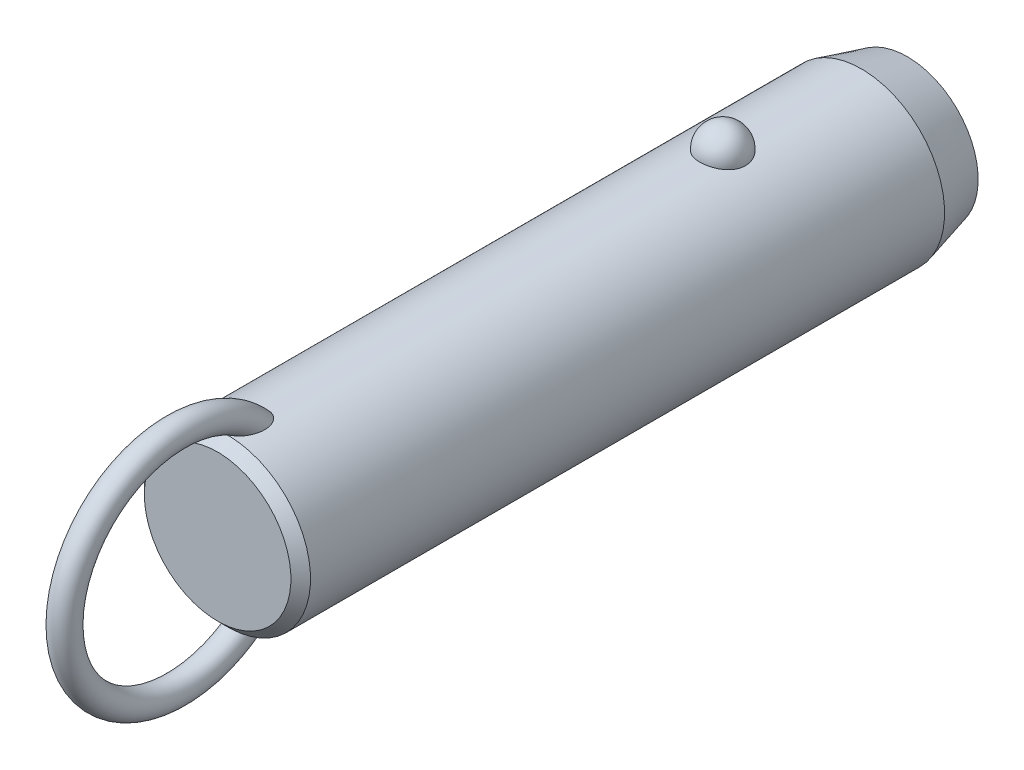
ISO-10303-21;
HEADER;
FILE_DESCRIPTION(('STEP AP214'),'2;1');
FILE_NAME('part.step','',(''),(''),'','','');
FILE_SCHEMA(('AUTOMOTIVE_DESIGN { 1 0 10303 214 1 1 1 1 }'));
ENDSEC;
DATA;
#1=APPLICATION_CONTEXT('core data for automotive mechanical design processes');
#2=APPLICATION_PROTOCOL_DEFINITION('international standard','automotive_design',2000,#1);
#3=PRODUCT_CONTEXT('',#1,'mechanical');
#4=PRODUCT('Part','Part','',(#3));
#5=PRODUCT_RELATED_PRODUCT_CATEGORY('part','',(#4));
#6=PRODUCT_DEFINITION_FORMATION('','',#4);
#7=PRODUCT_DEFINITION_CONTEXT('part definition',#1,'design');
#8=PRODUCT_DEFINITION('design','',#6,#7);
#9=PRODUCT_DEFINITION_SHAPE('','',#8);
#10=(LENGTH_UNIT() NAMED_UNIT(*) SI_UNIT(.MILLI.,.METRE.));
#11=(NAMED_UNIT(*) PLANE_ANGLE_UNIT() SI_UNIT($,.RADIAN.));
#12=(NAMED_UNIT(*) SI_UNIT($,.STERADIAN.) SOLID_ANGLE_UNIT());
#13=UNCERTAINTY_MEASURE_WITH_UNIT(LENGTH_MEASURE(1.E-05),#10,'distance_accuracy_value','');
#14=(GEOMETRIC_REPRESENTATION_CONTEXT(3) GLOBAL_UNCERTAINTY_ASSIGNED_CONTEXT((#13)) GLOBAL_UNIT_ASSIGNED_CONTEXT((#10,
#11,#12)) REPRESENTATION_CONTEXT('',''));
#15=CARTESIAN_POINT('',(0.,0.,0.));
#16=DIRECTION('',(0.,0.,1.));
#17=DIRECTION('',(1.,0.,0.));
#18=AXIS2_PLACEMENT_3D('',#15,#16,#17);
#19=CARTESIAN_POINT('',(0.,0.,61.));
#20=DIRECTION('',(0.,0.,-1.));
#21=DIRECTION('',(-1.,0.,0.));
#22=AXIS2_PLACEMENT_3D('',#19,#20,#21);
#23=CYLINDRICAL_SURFACE('',#22,12.7);
#24=CARTESIAN_POINT('',(3.46661256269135,12.2177165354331,-3.5));
#25=CARTESIAN_POINT('',(3.4666090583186,12.2177194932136,-3.30432790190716));
#26=CARTESIAN_POINT('',(3.45063567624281,12.2222841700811,-3.10861112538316));
#27=CARTESIAN_POINT('',(3.38712451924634,12.2400345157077,-2.72271899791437));
#28=CARTESIAN_POINT('',(3.33957415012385,12.2532236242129,-2.53254588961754));
#29=CARTESIAN_POINT('',(3.2141234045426,12.286724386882,-2.16324948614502));
#30=CARTESIAN_POINT('',(3.13623639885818,12.3070329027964,-1.98412136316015));
#31=CARTESIAN_POINT('',(2.95205930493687,12.3525018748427,-1.64180592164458));
#32=CARTESIAN_POINT('',(2.84577003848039,12.3776621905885,-1.47861814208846));
#33=CARTESIAN_POINT('',(2.60688050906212,12.4301712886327,-1.17190583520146));
#34=CARTESIAN_POINT('',(2.47415697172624,12.4575299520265,-1.02847897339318));
#35=CARTESIAN_POINT('',(2.18615174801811,12.5112810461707,-0.766177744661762));
#36=CARTESIAN_POINT('',(2.03087002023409,12.5376734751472,-0.64730342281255));
#37=CARTESIAN_POINT('',(1.70237334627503,12.5864761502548,-0.437732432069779));
#38=CARTESIAN_POINT('',(1.52920948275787,12.6088972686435,-0.346958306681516));
#39=CARTESIAN_POINT('',(1.16944170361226,12.6473352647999,-0.195750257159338));
#40=CARTESIAN_POINT('',(0.982839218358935,12.663352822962,-0.135313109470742));
#41=CARTESIAN_POINT('',(0.604961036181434,12.6869706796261,-0.0473241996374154));
#42=CARTESIAN_POINT('',(0.413823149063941,12.6947125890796,-0.0192185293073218));
#43=CARTESIAN_POINT('',(0.0293827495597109,12.7014203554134,0.00517254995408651));
#44=CARTESIAN_POINT('',(-0.163919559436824,12.7003870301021,0.00146092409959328));
#45=CARTESIAN_POINT('',(-0.544374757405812,12.689735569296,-0.0373939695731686));
#46=CARTESIAN_POINT('',(-0.731575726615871,12.6802364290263,-0.0721015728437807));
#47=CARTESIAN_POINT('',(-1.09733277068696,12.6538333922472,-0.171364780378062));
#48=CARTESIAN_POINT('',(-1.27588869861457,12.6369293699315,-0.235920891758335));
#49=CARTESIAN_POINT('',(-1.6204698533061,12.5973946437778,-0.393548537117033));
#50=CARTESIAN_POINT('',(-1.78641865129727,12.5747321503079,-0.486778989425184));
#51=CARTESIAN_POINT('',(-2.10030671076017,12.5261316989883,-0.699110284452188));
#52=CARTESIAN_POINT('',(-2.24824419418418,12.5001934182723,-0.818213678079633));
#53=CARTESIAN_POINT('',(-2.52491489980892,12.4472906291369,-1.08157124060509));
#54=CARTESIAN_POINT('',(-2.65324222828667,12.4203160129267,-1.22624992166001));
#55=CARTESIAN_POINT('',(-2.88410007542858,12.3687509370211,-1.53528325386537));
#56=CARTESIAN_POINT('',(-2.98662883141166,12.3441606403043,-1.69963924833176));
#57=CARTESIAN_POINT('',(-3.16432417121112,12.2998199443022,-2.04548497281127));
#58=CARTESIAN_POINT('',(-3.23917525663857,12.2801261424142,-2.22714424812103));
#59=CARTESIAN_POINT('',(-3.35800573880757,12.248167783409,-2.6009138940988));
#60=CARTESIAN_POINT('',(-3.4019860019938,12.2359030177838,-2.79302397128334));
#61=CARTESIAN_POINT('',(-3.45784812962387,12.2202347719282,-3.18140279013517));
#62=CARTESIAN_POINT('',(-3.46986123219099,12.2167950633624,-3.37765118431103));
#63=CARTESIAN_POINT('',(-3.46186273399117,12.2190638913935,-3.76943689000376));
#64=CARTESIAN_POINT('',(-3.44185196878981,12.2247721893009,-3.96497421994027));
#65=CARTESIAN_POINT('',(-3.37048652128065,12.2446381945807,-4.34881728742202));
#66=CARTESIAN_POINT('',(-3.31928253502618,12.2587552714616,-4.53715319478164));
#67=CARTESIAN_POINT('',(-3.18693461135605,12.2938237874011,-4.90231727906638));
#68=CARTESIAN_POINT('',(-3.1057895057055,12.3147754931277,-5.07914500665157));
#69=CARTESIAN_POINT('',(-2.91506431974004,12.3613125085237,-5.41732059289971));
#70=CARTESIAN_POINT('',(-2.80533587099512,12.3869217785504,-5.57858147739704));
#71=CARTESIAN_POINT('',(-2.560414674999,12.4398525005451,-5.88013283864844));
#72=CARTESIAN_POINT('',(-2.42522099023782,12.4671740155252,-6.02042254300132));
#73=CARTESIAN_POINT('',(-2.1323357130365,12.5205965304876,-6.27662798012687));
#74=CARTESIAN_POINT('',(-1.97456596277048,12.5466928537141,-6.3924554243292));
#75=CARTESIAN_POINT('',(-1.64115839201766,12.5946384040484,-6.59583547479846));
#76=CARTESIAN_POINT('',(-1.46552179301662,12.6164879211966,-6.68339001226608));
#77=CARTESIAN_POINT('',(-1.10356050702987,12.6532533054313,-6.82682153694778));
#78=CARTESIAN_POINT('',(-0.917391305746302,12.6682500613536,-6.8830698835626));
#79=CARTESIAN_POINT('',(-0.537836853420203,12.6900288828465,-6.96386887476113));
#80=CARTESIAN_POINT('',(-0.344452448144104,12.6968119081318,-6.9884232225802));
#81=CARTESIAN_POINT('',(0.0402577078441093,12.7013667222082,-7.00496469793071));
#82=CARTESIAN_POINT('',(0.231556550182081,12.6993008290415,-6.99753844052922));
#83=CARTESIAN_POINT('',(0.610105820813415,12.6867505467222,-6.9516636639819));
#84=CARTESIAN_POINT('',(0.797356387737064,12.6762664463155,-6.913216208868));
#85=CARTESIAN_POINT('',(1.16186657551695,12.6480587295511,-6.80658431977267));
#86=CARTESIAN_POINT('',(1.33915951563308,12.6303611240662,-6.73850666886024));
#87=CARTESIAN_POINT('',(1.67968518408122,12.5896027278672,-6.57450875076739));
#88=CARTESIAN_POINT('',(1.84291705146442,12.5665416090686,-6.47858678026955));
#89=CARTESIAN_POINT('',(2.15340192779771,12.5171072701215,-6.25982455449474));
#90=CARTESIAN_POINT('',(2.30037831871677,12.4906895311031,-6.13660186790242));
#91=CARTESIAN_POINT('',(2.5717412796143,12.4376567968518,-5.86739587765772));
#92=CARTESIAN_POINT('',(2.69612388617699,12.4110417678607,-5.72140858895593));
#93=CARTESIAN_POINT('',(2.92107785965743,12.360051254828,-5.40794137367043));
#94=CARTESIAN_POINT('',(3.02121329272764,12.3357209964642,-5.24014110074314));
#95=CARTESIAN_POINT('',(3.19236291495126,12.2925446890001,-4.8896986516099));
#96=CARTESIAN_POINT('',(3.26338839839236,12.2736965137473,-4.70706226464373));
#97=CARTESIAN_POINT('',(3.36788038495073,12.245404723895,-4.35469510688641));
#98=CARTESIAN_POINT('',(3.40484026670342,12.2351018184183,-4.18605935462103));
#99=CARTESIAN_POINT('',(3.45420764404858,12.2212564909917,-3.84496058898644));
#100=CARTESIAN_POINT('',(3.46661565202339,12.2177139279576,-3.67249765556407));
#101=CARTESIAN_POINT('',(3.46661256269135,12.2177165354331,-3.5));
#102=B_SPLINE_CURVE_WITH_KNOTS('',3,(#24,#25,#26,#27,#28,#29,#30,#31,#32,#33,#34,#35,#36,#37,
#38,#39,#40,#41,#42,#43,#44,#45,#46,#47,#48,#49,#50,#51,#52,#53,#54,#55,#56,#57,#58,#59,#60,#61,
#62,#63,#64,#65,#66,#67,#68,#69,#70,#71,#72,#73,#74,#75,#76,#77,#78,#79,#80,#81,#82,#83,#84,#85,
#86,#87,#88,#89,#90,#91,#92,#93,#94,#95,#96,#97,#98,#99,#100,#101),.UNSPECIFIED.,.T.,.F.,(4,2,2,
2,2,2,2,2,2,2,2,2,2,2,2,2,2,2,2,2,2,2,2,2,2,2,2,2,2,2,2,2,2,2,2,2,2,2,4),(0.,0.586396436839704,
1.17302689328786,1.7593990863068,2.34575431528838,2.93491084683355,3.52406845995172,
4.11158733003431,4.69904375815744,5.2762784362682,5.85345931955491,6.42265312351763,
6.99185659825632,7.56427334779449,8.136746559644,8.71981013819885,9.3029135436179,
9.89247258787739,10.4820150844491,11.0691335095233,11.6562366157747,12.2405256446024,
12.8248374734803,13.412244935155,13.9996740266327,14.5891883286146,15.1786623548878,
15.7609861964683,16.3432419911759,16.9148635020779,17.4864654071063,18.0560241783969,
18.6256177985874,19.2037609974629,19.7820055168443,20.3699810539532,20.9577282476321,
21.4746855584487,21.9916320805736),.UNSPECIFIED.);
#103=CARTESIAN_POINT('',(3.46661256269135,12.2177165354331,-3.5));
#104=VERTEX_POINT('',#103);
#105=EDGE_CURVE('E41',#104,#104,#102,.T.);
#106=ORIENTED_EDGE('',*,*,#105,.T.);
#107=EDGE_LOOP('',(#106));
#108=FACE_BOUND('',#107,.T.);
#109=CARTESIAN_POINT('',(0.,0.,72.2000000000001));
#110=DIRECTION('',(0.,0.,1.));
#111=DIRECTION('',(1.,0.,0.));
#112=AXIS2_PLACEMENT_3D('',#109,#110,#111);
#113=CIRCLE('',#112,12.7);
#114=CARTESIAN_POINT('',(-12.7,0.,72.2000000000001));
#115=VERTEX_POINT('',#114);
#116=EDGE_CURVE('E10',#115,#115,#113,.F.);
#117=ORIENTED_EDGE('',*,*,#116,.T.);
#118=EDGE_LOOP('',(#117));
#119=FACE_BOUND('',#118,.T.);
#120=CARTESIAN_POINT('',(-0.548122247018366,-12.6881662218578,65.9432187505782));
#121=CARTESIAN_POINT('',(-0.648865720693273,-12.6838128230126,65.977926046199));
#122=CARTESIAN_POINT('',(-0.746398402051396,-12.6783867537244,66.0220428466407));
#123=CARTESIAN_POINT('',(-0.932125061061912,-12.666091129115,66.1267647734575));
#124=CARTESIAN_POINT('',(-1.02030388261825,-12.6592192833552,66.187396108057));
#125=CARTESIAN_POINT('',(-1.18487740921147,-12.6448747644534,66.321847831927));
#126=CARTESIAN_POINT('',(-1.26134296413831,-12.637406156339,66.3955825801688));
#127=CARTESIAN_POINT('',(-1.4023120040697,-12.6225412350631,66.5536045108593));
#128=CARTESIAN_POINT('',(-1.466814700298,-12.6151449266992,66.6378923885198));
#129=CARTESIAN_POINT('',(-1.60714786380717,-12.5981718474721,66.8496577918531));
#130=CARTESIAN_POINT('',(-1.67725126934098,-12.588900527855,66.980962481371));
#131=CARTESIAN_POINT('',(-1.79536591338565,-12.5725964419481,67.2532471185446));
#132=CARTESIAN_POINT('',(-1.84333535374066,-12.5655679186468,67.3942447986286));
#133=CARTESIAN_POINT('',(-1.93422576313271,-12.5519624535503,67.7376455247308));
#134=CARTESIAN_POINT('',(-1.96788773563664,-12.5466298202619,67.9425578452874));
#135=CARTESIAN_POINT('',(-1.9941399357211,-12.542463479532,68.2517600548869));
#136=CARTESIAN_POINT('',(-1.99883864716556,-12.5417153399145,68.3552987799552));
#137=CARTESIAN_POINT('',(-2.00078003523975,-12.5414074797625,68.5624512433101));
#138=CARTESIAN_POINT('',(-1.99802449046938,-12.5418474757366,68.6660649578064));
#139=CARTESIAN_POINT('',(-1.98336733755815,-12.5441750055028,68.9103207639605));
#140=CARTESIAN_POINT('',(-1.96851430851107,-12.5465291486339,69.0507804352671));
#141=CARTESIAN_POINT('',(-1.92707089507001,-12.5529612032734,69.3299607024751));
#142=CARTESIAN_POINT('',(-1.900474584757,-12.5570399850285,69.4686803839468));
#143=CARTESIAN_POINT('',(-1.83619120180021,-12.5666008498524,69.7434113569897));
#144=CARTESIAN_POINT('',(-1.79850828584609,-12.57208240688,69.8794236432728));
#145=CARTESIAN_POINT('',(-1.71223796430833,-12.5841228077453,70.1478421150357));
#146=CARTESIAN_POINT('',(-1.66365679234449,-12.5906810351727,70.2802503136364));
#147=CARTESIAN_POINT('',(-1.57804503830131,-12.6016176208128,70.4854887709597));
#148=CARTESIAN_POINT('',(-1.54477252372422,-12.6057501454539,70.5599149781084));
#149=CARTESIAN_POINT('',(-1.47424480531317,-12.6141930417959,70.7068393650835));
#150=CARTESIAN_POINT('',(-1.43699041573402,-12.6185033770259,70.7793379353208));
#151=CARTESIAN_POINT('',(-1.35825795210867,-12.6272207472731,70.9218926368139));
#152=CARTESIAN_POINT('',(-1.31678520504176,-12.6316276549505,70.9919517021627));
#153=CARTESIAN_POINT('',(-1.22917793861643,-12.6404532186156,71.1290705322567));
#154=CARTESIAN_POINT('',(-1.18304514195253,-12.6448718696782,71.1961313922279));
#155=CARTESIAN_POINT('',(-1.0724641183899,-12.6547893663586,71.3438741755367));
#156=CARTESIAN_POINT('',(-1.00642239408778,-12.6602600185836,71.4233844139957));
#157=CARTESIAN_POINT('',(-0.864441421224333,-12.6707460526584,71.5731698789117));
#158=CARTESIAN_POINT('',(-0.788516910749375,-12.6757620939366,71.6434585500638));
#159=CARTESIAN_POINT('',(-0.652215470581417,-12.6833591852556,71.7486801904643));
#160=CARTESIAN_POINT('',(-0.594982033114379,-12.6861973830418,71.7876241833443));
#161=CARTESIAN_POINT('',(-0.475269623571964,-12.6912445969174,71.8564899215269));
#162=CARTESIAN_POINT('',(-0.412800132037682,-12.6934547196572,71.8864275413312));
#163=CARTESIAN_POINT('',(-0.295749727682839,-12.6966636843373,71.9297565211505));
#164=CARTESIAN_POINT('',(-0.241949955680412,-12.6978134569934,71.9452188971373));
#165=CARTESIAN_POINT('',(-0.132508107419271,-12.6994261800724,71.9668845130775));
#166=CARTESIAN_POINT('',(-0.0768679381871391,-12.6998898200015,71.9730970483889));
#167=CARTESIAN_POINT('',(0.0347696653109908,-12.7000752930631,71.9755838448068));
#168=CARTESIAN_POINT('',(0.090767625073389,-12.6997954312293,71.9718353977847));
#169=CARTESIAN_POINT('',(0.201283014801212,-12.6985255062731,71.9547883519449));
#170=CARTESIAN_POINT('',(0.255799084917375,-12.6975348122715,71.9414812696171));
#171=CARTESIAN_POINT('',(0.376042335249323,-12.6946091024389,71.9020379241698));
#172=CARTESIAN_POINT('',(0.440950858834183,-12.6924943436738,71.8734492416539));
#173=CARTESIAN_POINT('',(0.56535027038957,-12.6875639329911,71.8063234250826));
#174=CARTESIAN_POINT('',(0.62482897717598,-12.6847467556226,71.7677646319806));
#175=CARTESIAN_POINT('',(0.774116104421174,-12.6767252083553,71.656949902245));
#176=CARTESIAN_POINT('',(0.859449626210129,-12.6711344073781,71.5787605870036));
#177=CARTESIAN_POINT('',(1.01789440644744,-12.6593922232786,71.410943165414));
#178=CARTESIAN_POINT('',(1.09096902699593,-12.653239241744,71.321282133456));
#179=CARTESIAN_POINT('',(1.22268793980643,-12.6411674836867,71.1402658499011));
#180=CARTESIAN_POINT('',(1.28193986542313,-12.6352572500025,71.049345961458));
#181=CARTESIAN_POINT('',(1.39259777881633,-12.6235401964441,70.8627929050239));
#182=CARTESIAN_POINT('',(1.44399707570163,-12.6177334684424,70.7671558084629));
#183=CARTESIAN_POINT('',(1.53972870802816,-12.6064093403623,70.5722738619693));
#184=CARTESIAN_POINT('',(1.58405262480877,-12.6008922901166,70.4730248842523));
#185=CARTESIAN_POINT('',(1.66600705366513,-12.5903187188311,70.2717727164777));
#186=CARTESIAN_POINT('',(1.70363651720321,-12.5852622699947,70.1697690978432));
#187=CARTESIAN_POINT('',(1.77545379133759,-12.5753406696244,69.9543580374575));
#188=CARTESIAN_POINT('',(1.80903453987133,-12.5705328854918,69.840745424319));
#189=CARTESIAN_POINT('',(1.86844163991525,-12.5618400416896,69.6114575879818));
#190=CARTESIAN_POINT('',(1.89426665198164,-12.5579551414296,69.4957820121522));
#191=CARTESIAN_POINT('',(1.9378546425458,-12.5513030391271,69.2630072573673));
#192=CARTESIAN_POINT('',(1.95562640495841,-12.5485346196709,69.1459097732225));
#193=CARTESIAN_POINT('',(1.98264463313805,-12.5442934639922,68.9107473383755));
#194=CARTESIAN_POINT('',(1.99189298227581,-12.5428204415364,68.7926826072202));
#195=CARTESIAN_POINT('',(2.00416068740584,-12.540871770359,68.4806225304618));
#196=CARTESIAN_POINT('',(1.99944433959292,-12.541631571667,68.2862290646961));
#197=CARTESIAN_POINT('',(1.96113755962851,-12.5476846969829,67.9003095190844));
#198=CARTESIAN_POINT('',(1.92758341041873,-12.5529723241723,67.7087801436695));
#199=CARTESIAN_POINT('',(1.8393434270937,-12.5661532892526,67.3822728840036));
#200=CARTESIAN_POINT('',(1.79215440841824,-12.5730485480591,67.2452499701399));
#201=CARTESIAN_POINT('',(1.67676242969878,-12.588958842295,66.980445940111));
#202=CARTESIAN_POINT('',(1.60859050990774,-12.597970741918,66.8526515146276));
#203=CARTESIAN_POINT('',(1.46583832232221,-12.6152829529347,66.6358006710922));
#204=CARTESIAN_POINT('',(1.39525727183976,-12.6233659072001,66.5441050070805));
#205=CARTESIAN_POINT('',(1.23992594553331,-12.6395676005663,66.3734854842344));
#206=CARTESIAN_POINT('',(1.15517932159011,-12.6476863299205,66.2945583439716));
#207=CARTESIAN_POINT('',(0.971995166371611,-12.6630846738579,66.1526438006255));
#208=CARTESIAN_POINT('',(0.873456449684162,-12.6703572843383,66.0897849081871));
#209=CARTESIAN_POINT('',(0.665847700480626,-12.6829569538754,65.9844870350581));
#210=CARTESIAN_POINT('',(0.556784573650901,-12.688285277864,65.9420347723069));
#211=CARTESIAN_POINT('',(0.347338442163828,-12.6956226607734,65.8844434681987));
#212=CARTESIAN_POINT('',(0.247759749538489,-12.6979816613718,65.8663996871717));
#213=CARTESIAN_POINT('',(0.047021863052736,-12.7003077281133,65.8486007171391));
#214=CARTESIAN_POINT('',(-0.0541350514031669,-12.7002779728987,65.8488212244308));
#215=CARTESIAN_POINT('',(-0.221414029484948,-12.6982482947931,65.8643639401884));
#216=CARTESIAN_POINT('',(-0.288055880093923,-12.6969033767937,65.8746662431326));
#217=CARTESIAN_POINT('',(-0.419599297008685,-12.6932369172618,65.9031348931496));
#218=CARTESIAN_POINT('',(-0.484501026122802,-12.6909154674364,65.9213005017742));
#219=CARTESIAN_POINT('',(-0.548122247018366,-12.6881662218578,65.9432187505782));
#220=B_SPLINE_CURVE_WITH_KNOTS('',3,(#120,#121,#122,#123,#124,#125,#126,#127,#128,#129,#130,
#131,#132,#133,#134,#135,#136,#137,#138,#139,#140,#141,#142,#143,#144,#145,#146,#147,#148,#149,
#150,#151,#152,#153,#154,#155,#156,#157,#158,#159,#160,#161,#162,#163,#164,#165,#166,#167,#168,
#169,#170,#171,#172,#173,#174,#175,#176,#177,#178,#179,#180,#181,#182,#183,#184,#185,#186,#187,
#188,#189,#190,#191,#192,#193,#194,#195,#196,#197,#198,#199,#200,#201,#202,#203,#204,#205,#206,
#207,#208,#209,#210,#211,#212,#213,#214,#215,#216,#217,#218,#219),.UNSPECIFIED.,.T.,.F.,(4,2,2,
2,2,2,2,2,2,2,2,2,2,2,2,2,2,2,2,2,2,2,2,2,2,2,2,2,2,2,2,2,2,2,2,2,2,2,2,2,2,2,2,2,2,2,2,2,2,4),
(0.,0.319642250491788,0.639794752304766,0.957927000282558,1.27608021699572,1.72100165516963,
2.16675988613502,2.78630021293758,3.09705782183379,3.40774128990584,3.83096358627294,
4.2543996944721,4.67767724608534,5.10071330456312,5.34550297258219,5.59024267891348,
5.8346770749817,6.07902143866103,6.38891080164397,6.69834321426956,6.90560910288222,
7.11250749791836,7.27977315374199,7.44687060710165,7.6143493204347,7.78197685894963,
7.99365544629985,8.20579780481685,8.55147335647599,8.89816429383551,9.22375138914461,
9.5496143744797,9.87586224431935,10.202161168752,10.5575872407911,10.9130746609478,
11.2681734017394,11.6231936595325,12.2046601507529,12.7853961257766,13.219164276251,
13.6522938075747,13.9989174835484,14.3454519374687,14.6946768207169,15.0436740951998,
15.3457513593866,15.6474266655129,15.8493051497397,16.0511646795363),.UNSPECIFIED.);
#221=CARTESIAN_POINT('',(-0.548122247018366,-12.6881662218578,65.9432187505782));
#222=VERTEX_POINT('',#221);
#223=EDGE_CURVE('E58',#222,#222,#220,.T.);
#224=ORIENTED_EDGE('',*,*,#223,.T.);
#225=EDGE_LOOP('',(#224));
#226=FACE_BOUND('',#225,.T.);
#227=CARTESIAN_POINT('',(-0.548122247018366,12.6881662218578,65.9432187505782));
#228=CARTESIAN_POINT('',(-0.459436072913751,12.6919968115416,65.912673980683));
#229=CARTESIAN_POINT('',(-0.368189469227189,12.6949996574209,65.8893913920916));
#230=CARTESIAN_POINT('',(-0.183024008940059,12.6990186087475,65.8584062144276));
#231=CARTESIAN_POINT('',(-0.0891049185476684,12.7000345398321,65.8507049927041));
#232=CARTESIAN_POINT('',(0.0987147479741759,12.6999636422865,65.8512455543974));
#233=CARTESIAN_POINT('',(0.19261531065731,12.6988761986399,65.859492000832));
#234=CARTESIAN_POINT('',(0.377658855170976,12.6947211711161,65.8915515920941));
#235=CARTESIAN_POINT('',(0.468801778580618,12.6916535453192,65.9153650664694));
#236=CARTESIAN_POINT('',(0.645809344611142,12.6838788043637,65.9774565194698));
#237=CARTESIAN_POINT('',(0.731679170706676,12.6791733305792,66.015720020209));
#238=CARTESIAN_POINT('',(0.896315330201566,12.6686004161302,66.105120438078));
#239=CARTESIAN_POINT('',(0.975080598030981,12.6627328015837,66.1562592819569));
#240=CARTESIAN_POINT('',(1.12963655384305,12.6499161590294,66.2736782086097));
#241=CARTESIAN_POINT('',(1.20478673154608,12.6429194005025,66.3407929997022));
#242=CARTESIAN_POINT('',(1.34448241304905,12.6288282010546,66.4852250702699));
#243=CARTESIAN_POINT('',(1.40902173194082,12.621733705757,66.5625482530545));
#244=CARTESIAN_POINT('',(1.55208211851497,12.6050877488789,66.7592475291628));
#245=CARTESIAN_POINT('',(1.62510490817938,12.5957546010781,66.8826540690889));
#246=CARTESIAN_POINT('',(1.75019044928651,12.5789823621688,67.1397690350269));
#247=CARTESIAN_POINT('',(1.80221377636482,12.5715468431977,67.273496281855));
#248=CARTESIAN_POINT('',(1.90309965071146,12.5567434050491,67.5983516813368));
#249=CARTESIAN_POINT('',(1.94342317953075,12.5504515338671,67.7921611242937));
#250=CARTESIAN_POINT('',(1.99332997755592,12.5426147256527,68.1837881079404));
#251=CARTESIAN_POINT('',(2.00285305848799,12.5410790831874,68.3816127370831));
#252=CARTESIAN_POINT('',(1.99678999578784,12.5420407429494,68.7166427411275));
#253=CARTESIAN_POINT('',(1.98794117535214,12.5434564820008,68.8540428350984));
#254=CARTESIAN_POINT('',(1.95865119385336,12.5480641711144,69.1276394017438));
#255=CARTESIAN_POINT('',(1.93820436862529,12.5512569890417,69.2638352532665));
#256=CARTESIAN_POINT('',(1.88647896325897,12.5591352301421,69.5342493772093));
#257=CARTESIAN_POINT('',(1.85518800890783,12.5638223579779,69.6684652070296));
#258=CARTESIAN_POINT('',(1.78217886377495,12.5743868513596,69.9339362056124));
#259=CARTESIAN_POINT('',(1.74046509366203,12.5802637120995,70.0651926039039));
#260=CARTESIAN_POINT('',(1.66024095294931,12.5910571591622,70.2860855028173));
#261=CARTESIAN_POINT('',(1.62434772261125,12.5957535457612,70.3766904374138));
#262=CARTESIAN_POINT('',(1.54709009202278,12.6054762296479,70.5555125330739));
#263=CARTESIAN_POINT('',(1.50572681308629,12.6105024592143,70.6437301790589));
#264=CARTESIAN_POINT('',(1.4172802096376,12.620748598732,70.8169321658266));
#265=CARTESIAN_POINT('',(1.37021377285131,12.625967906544,70.9019251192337));
#266=CARTESIAN_POINT('',(1.26969620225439,12.6364721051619,71.0680072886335));
#267=CARTESIAN_POINT('',(1.21624929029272,12.6417569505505,71.1490990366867));
#268=CARTESIAN_POINT('',(1.10304413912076,12.6521331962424,71.3047027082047));
#269=CARTESIAN_POINT('',(1.04340936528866,12.657226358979,71.3793033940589));
#270=CARTESIAN_POINT('',(0.915919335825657,12.6670906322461,71.521324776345));
#271=CARTESIAN_POINT('',(0.848064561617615,12.6718617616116,71.5887458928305));
#272=CARTESIAN_POINT('',(0.71703570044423,12.67987711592,71.7006247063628));
#273=CARTESIAN_POINT('',(0.655526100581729,12.6832377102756,71.7469970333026));
#274=CARTESIAN_POINT('',(0.525985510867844,12.6892676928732,71.8296195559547));
#275=CARTESIAN_POINT('',(0.457969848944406,12.6919386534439,71.8658927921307));
#276=CARTESIAN_POINT('',(0.334859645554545,12.695691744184,71.9166572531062));
#277=CARTESIAN_POINT('',(0.281116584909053,12.6970073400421,71.9343733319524));
#278=CARTESIAN_POINT('',(0.171425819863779,12.6989609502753,71.9606429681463));
#279=CARTESIAN_POINT('',(0.115480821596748,12.699599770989,71.9692074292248));
#280=CARTESIAN_POINT('',(0.00272618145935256,12.7001251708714,71.9762531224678));
#281=CARTESIAN_POINT('',(-0.0540859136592,12.7000089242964,71.9746964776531));
#282=CARTESIAN_POINT('',(-0.166544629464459,12.6990328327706,71.9616005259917));
#283=CARTESIAN_POINT('',(-0.222190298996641,12.6981724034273,71.9500533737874));
#284=CARTESIAN_POINT('',(-0.342018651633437,12.695562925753,71.9149128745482));
#285=CARTESIAN_POINT('',(-0.405606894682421,12.6936676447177,71.8893322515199));
#286=CARTESIAN_POINT('',(-0.527815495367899,12.6891754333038,71.8283111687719));
#287=CARTESIAN_POINT('',(-0.586425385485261,12.6865770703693,71.7928505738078));
#288=CARTESIAN_POINT('',(-0.731842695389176,12.6792129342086,71.6914960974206));
#289=CARTESIAN_POINT('',(-0.814709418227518,12.6740767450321,71.6200395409));
#290=CARTESIAN_POINT('',(-0.96910175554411,12.6632083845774,71.4658900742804));
#291=CARTESIAN_POINT('',(-1.04059564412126,12.6574746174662,71.3831668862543));
#292=CARTESIAN_POINT('',(-1.1698111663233,12.6461638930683,71.2158096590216));
#293=CARTESIAN_POINT('',(-1.22811369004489,12.6405994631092,71.1316166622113));
#294=CARTESIAN_POINT('',(-1.33743405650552,12.6295007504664,70.9585791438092));
#295=CARTESIAN_POINT('',(-1.38844577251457,12.6239664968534,70.8697307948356));
#296=CARTESIAN_POINT('',(-1.48400702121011,12.6130898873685,70.688389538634));
#297=CARTESIAN_POINT('',(-1.52854232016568,12.6077479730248,70.5958891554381));
#298=CARTESIAN_POINT('',(-1.61150113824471,12.5974127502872,70.4081607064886));
#299=CARTESIAN_POINT('',(-1.64992317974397,12.5924195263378,70.3129319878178));
#300=CARTESIAN_POINT('',(-1.73468589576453,12.581070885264,70.0828936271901));
#301=CARTESIAN_POINT('',(-1.77831261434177,12.5749388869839,69.9470661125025));
#302=CARTESIAN_POINT('',(-1.85439734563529,12.5639437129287,69.6722128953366));
#303=CARTESIAN_POINT('',(-1.88684994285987,12.5590811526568,69.5331856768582));
#304=CARTESIAN_POINT('',(-1.9400848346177,12.550968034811,69.2530923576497));
#305=CARTESIAN_POINT('',(-1.96088706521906,12.5477147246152,69.1120301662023));
#306=CARTESIAN_POINT('',(-1.99000539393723,12.5431291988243,68.8286689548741));
#307=CARTESIAN_POINT('',(-1.99832911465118,12.5417958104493,68.6863707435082));
#308=CARTESIAN_POINT('',(-2.00166624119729,12.5412674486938,68.3576271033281));
#309=CARTESIAN_POINT('',(-1.99178843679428,12.5428579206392,68.171088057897));
#310=CARTESIAN_POINT('',(-1.9445518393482,12.5502731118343,67.8016240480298));
#311=CARTESIAN_POINT('',(-1.90724032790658,12.5560905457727,67.6186934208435));
#312=CARTESIAN_POINT('',(-1.81330718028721,12.5699462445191,67.3048488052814));
#313=CARTESIAN_POINT('',(-1.76338820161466,12.5771273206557,67.1719105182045));
#314=CARTESIAN_POINT('',(-1.6430501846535,12.593414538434,66.9156813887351));
#315=CARTESIAN_POINT('',(-1.57265346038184,12.6025185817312,66.792380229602));
#316=CARTESIAN_POINT('',(-1.42634956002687,12.6198178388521,66.5835648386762));
#317=CARTESIAN_POINT('',(-1.35423772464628,12.6278405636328,66.4953846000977));
#318=CARTESIAN_POINT('',(-1.19645664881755,12.6437632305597,66.332107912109));
#319=CARTESIAN_POINT('',(-1.11080536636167,12.6516633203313,66.2569944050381));
#320=CARTESIAN_POINT('',(-0.947219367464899,12.6648319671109,66.1378114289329));
#321=CARTESIAN_POINT('',(-0.871624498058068,12.670300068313,66.0905414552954));
#322=CARTESIAN_POINT('',(-0.714161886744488,12.6801492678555,66.0077413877));
#323=CARTESIAN_POINT('',(-0.632295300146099,12.684530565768,65.9722091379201));
#324=CARTESIAN_POINT('',(-0.548122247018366,12.6881662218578,65.9432187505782));
#325=B_SPLINE_CURVE_WITH_KNOTS('',3,(#227,#228,#229,#230,#231,#232,#233,#234,#235,#236,#237,
#238,#239,#240,#241,#242,#243,#244,#245,#246,#247,#248,#249,#250,#251,#252,#253,#254,#255,#256,
#257,#258,#259,#260,#261,#262,#263,#264,#265,#266,#267,#268,#269,#270,#271,#272,#273,#274,#275,
#276,#277,#278,#279,#280,#281,#282,#283,#284,#285,#286,#287,#288,#289,#290,#291,#292,#293,#294,
#295,#296,#297,#298,#299,#300,#301,#302,#303,#304,#305,#306,#307,#308,#309,#310,#311,#312,#313,
#314,#315,#316,#317,#318,#319,#320,#321,#322,#323,#324),.UNSPECIFIED.,.T.,.F.,(4,2,2,2,2,2,2,2,
2,2,2,2,2,2,2,2,2,2,2,2,2,2,2,2,2,2,2,2,2,2,2,2,2,2,2,2,2,2,2,2,2,2,2,2,2,2,2,2,4),(0.,
0.281328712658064,0.562682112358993,0.844117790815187,1.12555942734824,1.40671982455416,
1.68792232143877,1.98972294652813,2.29169886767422,2.72039860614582,3.14989948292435,
3.74084916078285,4.33295293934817,4.745541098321,5.1583309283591,5.57159335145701,
5.98468079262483,6.27722775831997,6.56971484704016,6.86135609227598,7.15280542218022,
7.43927407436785,7.72572595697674,7.95635862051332,8.18646071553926,8.35559393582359,
8.52452541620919,8.69408946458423,8.86378678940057,9.06834348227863,9.27332014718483,
9.60010414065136,9.9277843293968,10.2350252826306,10.5425229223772,10.8506864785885,
11.1589244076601,11.5867893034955,12.0148612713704,12.4421984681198,12.8692745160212,
13.4279365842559,13.9856380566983,14.4107062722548,14.8353130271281,15.1765567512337,
15.5173516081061,15.7844129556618,16.051425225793),.UNSPECIFIED.);
#326=CARTESIAN_POINT('',(-0.548122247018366,12.6881662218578,65.9432187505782));
#327=VERTEX_POINT('',#326);
#328=EDGE_CURVE('E66',#327,#327,#325,.T.);
#329=ORIENTED_EDGE('',*,*,#328,.T.);
#330=EDGE_LOOP('',(#329));
#331=FACE_BOUND('',#330,.T.);
#332=CARTESIAN_POINT('',(0.,0.,-24.7000000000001));
#333=DIRECTION('',(0.,0.,-1.));
#334=DIRECTION('',(-1.,0.,0.));
#335=AXIS2_PLACEMENT_3D('',#332,#333,#334);
#336=CIRCLE('',#335,12.7);
#337=CARTESIAN_POINT('',(-12.7,0.,-24.7000000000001));
#338=VERTEX_POINT('',#337);
#339=EDGE_CURVE('E55',#338,#338,#336,.F.);
#340=ORIENTED_EDGE('',*,*,#339,.T.);
#341=EDGE_LOOP('',(#340));
#342=FACE_BOUND('',#341,.T.);
#343=ADVANCED_FACE('F37',(#108,#119,#226,#331,#342),#23,.T.);
#344=CARTESIAN_POINT('',(0.,0.,-31.7));
#345=DIRECTION('',(0.,0.,-1.));
#346=DIRECTION('',(-1.,0.,0.));
#347=AXIS2_PLACEMENT_3D('',#344,#345,#346);
#348=PLANE('',#347);
#349=CARTESIAN_POINT('',(0.,0.,-31.7));
#350=DIRECTION('',(0.,0.,-1.));
#351=DIRECTION('',(-1.,0.,0.));
#352=AXIS2_PLACEMENT_3D('',#349,#350,#351);
#353=CIRCLE('',#352,10.8243556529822);
#354=CARTESIAN_POINT('',(-10.8243556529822,0.,-31.7));
#355=VERTEX_POINT('',#354);
#356=EDGE_CURVE('E65',#355,#355,#353,.T.);
#357=ORIENTED_EDGE('',*,*,#356,.T.);
#358=EDGE_LOOP('',(#357));
#359=FACE_BOUND('',#358,.T.);
#360=ADVANCED_FACE('F84',(#359),#348,.T.);
#361=CARTESIAN_POINT('',(0.,0.,-31.7));
#362=DIRECTION('',(0.,0.,1.));
#363=DIRECTION('',(1.,0.,0.));
#364=AXIS2_PLACEMENT_3D('',#361,#362,#363);
#365=CONICAL_SURFACE('',#364,10.8243556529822,0.261799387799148);
#366=ORIENTED_EDGE('',*,*,#339,.F.);
#367=EDGE_LOOP('',(#366));
#368=FACE_BOUND('',#367,.T.);
#369=ORIENTED_EDGE('',*,*,#356,.F.);
#370=EDGE_LOOP('',(#369));
#371=FACE_BOUND('',#370,.T.);
#372=ADVANCED_FACE('F82',(#368,#371),#365,.T.);
#373=CARTESIAN_POINT('',(0.,0.,73.7));
#374=DIRECTION('',(0.,0.,1.));
#375=DIRECTION('',(1.,0.,0.));
#376=AXIS2_PLACEMENT_3D('',#373,#374,#375);
#377=PLANE('',#376);
#378=CARTESIAN_POINT('',(0.,0.,73.7));
#379=DIRECTION('',(0.,0.,1.));
#380=DIRECTION('',(1.,0.,0.));
#381=AXIS2_PLACEMENT_3D('',#378,#379,#380);
#382=CIRCLE('',#381,11.2000000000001);
#383=CARTESIAN_POINT('',(-11.2000000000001,0.,73.7));
#384=VERTEX_POINT('',#383);
#385=EDGE_CURVE('E50',#384,#384,#382,.T.);
#386=ORIENTED_EDGE('',*,*,#385,.T.);
#387=EDGE_LOOP('',(#386));
#388=FACE_BOUND('',#387,.T.);
#389=ADVANCED_FACE('F76',(#388),#377,.T.);
#390=CARTESIAN_POINT('',(0.,0.,80.05));
#391=DIRECTION('',(1.,0.,0.));
#392=DIRECTION('',(0.,0.,-1.));
#393=AXIS2_PLACEMENT_3D('',#390,#391,#392);
#394=TOROIDAL_SURFACE('',#393,17.05,2.);
#395=ORIENTED_EDGE('',*,*,#328,.F.);
#396=EDGE_LOOP('',(#395));
#397=FACE_BOUND('',#396,.T.);
#398=ORIENTED_EDGE('',*,*,#223,.F.);
#399=EDGE_LOOP('',(#398));
#400=FACE_BOUND('',#399,.T.);
#401=ADVANCED_FACE('F72',(#397,#400),#394,.T.);
#402=CARTESIAN_POINT('',(0.,0.,73.7));
#403=DIRECTION('',(0.,0.,-1.));
#404=DIRECTION('',(-1.,0.,0.));
#405=AXIS2_PLACEMENT_3D('',#402,#403,#404);
#406=CONICAL_SURFACE('',#405,11.2000000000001,0.785398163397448);
#407=CARTESIAN_POINT('',(-12.7,0.,72.2000000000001));
#408=CARTESIAN_POINT('',(-12.684375,0.,72.2156250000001));
#409=CARTESIAN_POINT('',(-12.66875,0.,72.23125));
#410=CARTESIAN_POINT('',(-12.6375,0.,72.2625000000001));
#411=CARTESIAN_POINT('',(-12.621875,0.,72.2781250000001));
#412=CARTESIAN_POINT('',(-12.590625,0.,72.3093750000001));
#413=CARTESIAN_POINT('',(-12.575,0.,72.3250000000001));
#414=CARTESIAN_POINT('',(-12.54375,0.,72.35625));
#415=CARTESIAN_POINT('',(-12.528125,0.,72.3718750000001));
#416=CARTESIAN_POINT('',(-12.496875,0.,72.4031250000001));
#417=CARTESIAN_POINT('',(-12.48125,0.,72.41875));
#418=CARTESIAN_POINT('',(-12.45,0.,72.4500000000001));
#419=CARTESIAN_POINT('',(-12.434375,0.,72.465625));
#420=CARTESIAN_POINT('',(-12.403125,0.,72.4968750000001));
#421=CARTESIAN_POINT('',(-12.3875,0.,72.5125));
#422=CARTESIAN_POINT('',(-12.35625,0.,72.54375));
#423=CARTESIAN_POINT('',(-12.340625,0.,72.559375));
#424=CARTESIAN_POINT('',(-12.309375,0.,72.590625));
#425=CARTESIAN_POINT('',(-12.29375,0.,72.60625));
#426=CARTESIAN_POINT('',(-12.2625,0.,72.6375));
#427=CARTESIAN_POINT('',(-12.246875,0.,72.653125));
#428=CARTESIAN_POINT('',(-12.215625,0.,72.684375));
#429=CARTESIAN_POINT('',(-12.2,0.,72.7));
#430=CARTESIAN_POINT('',(-12.16875,0.,72.73125));
#431=CARTESIAN_POINT('',(-12.153125,0.,72.746875));
#432=CARTESIAN_POINT('',(-12.121875,0.,72.778125));
#433=CARTESIAN_POINT('',(-12.10625,0.,72.79375));
#434=CARTESIAN_POINT('',(-12.075,0.,72.825));
#435=CARTESIAN_POINT('',(-12.059375,0.,72.840625));
#436=CARTESIAN_POINT('',(-12.028125,0.,72.871875));
#437=CARTESIAN_POINT('',(-12.0125,0.,72.8875));
#438=CARTESIAN_POINT('',(-11.98125,0.,72.91875));
#439=CARTESIAN_POINT('',(-11.965625,0.,72.934375));
#440=CARTESIAN_POINT('',(-11.934375,0.,72.965625));
#441=CARTESIAN_POINT('',(-11.91875,0.,72.98125));
#442=CARTESIAN_POINT('',(-11.8875,0.,73.0125));
#443=CARTESIAN_POINT('',(-11.871875,0.,73.028125));
#444=CARTESIAN_POINT('',(-11.840625,0.,73.059375));
#445=CARTESIAN_POINT('',(-11.825,0.,73.075));
#446=CARTESIAN_POINT('',(-11.7937500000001,0.,73.10625));
#447=CARTESIAN_POINT('',(-11.7781250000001,0.,73.121875));
#448=CARTESIAN_POINT('',(-11.7468750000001,0.,73.153125));
#449=CARTESIAN_POINT('',(-11.7312500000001,0.,73.16875));
#450=CARTESIAN_POINT('',(-11.7000000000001,0.,73.2));
#451=CARTESIAN_POINT('',(-11.6843750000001,0.,73.215625));
#452=CARTESIAN_POINT('',(-11.6531250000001,0.,73.246875));
#453=CARTESIAN_POINT('',(-11.6375000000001,0.,73.2625));
#454=CARTESIAN_POINT('',(-11.6062500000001,0.,73.29375));
#455=CARTESIAN_POINT('',(-11.5906250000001,0.,73.309375));
#456=CARTESIAN_POINT('',(-11.5593750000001,0.,73.340625));
#457=CARTESIAN_POINT('',(-11.5437500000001,0.,73.35625));
#458=CARTESIAN_POINT('',(-11.5125000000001,0.,73.3875));
#459=CARTESIAN_POINT('',(-11.4968750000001,0.,73.403125));
#460=CARTESIAN_POINT('',(-11.4656250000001,0.,73.434375));
#461=CARTESIAN_POINT('',(-11.4500000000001,0.,73.45));
#462=CARTESIAN_POINT('',(-11.4187500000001,0.,73.48125));
#463=CARTESIAN_POINT('',(-11.4031250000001,0.,73.496875));
#464=CARTESIAN_POINT('',(-11.3718750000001,0.,73.528125));
#465=CARTESIAN_POINT('',(-11.3562500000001,0.,73.54375));
#466=CARTESIAN_POINT('',(-11.3250000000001,0.,73.575));
#467=CARTESIAN_POINT('',(-11.3093750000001,0.,73.590625));
#468=CARTESIAN_POINT('',(-11.2781250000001,0.,73.621875));
#469=CARTESIAN_POINT('',(-11.2625000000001,0.,73.6375));
#470=CARTESIAN_POINT('',(-11.2312500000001,0.,73.66875));
#471=CARTESIAN_POINT('',(-11.2156250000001,0.,73.684375));
#472=CARTESIAN_POINT('',(-11.2000000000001,0.,73.7));
#473=B_SPLINE_CURVE_WITH_KNOTS('',3,(#407,#408,#409,#410,#411,#412,#413,#414,#415,#416,#417,
#418,#419,#420,#421,#422,#423,#424,#425,#426,#427,#428,#429,#430,#431,#432,#433,#434,#435,#436,
#437,#438,#439,#440,#441,#442,#443,#444,#445,#446,#447,#448,#449,#450,#451,#452,#453,#454,#455,
#456,#457,#458,#459,#460,#461,#462,#463,#464,#465,#466,#467,#468,#469,#470,#471,#472),
.UNSPECIFIED.,.F.,.F.,(4,2,2,2,2,2,2,2,2,2,2,2,2,2,2,2,2,2,2,2,2,2,2,2,2,2,2,2,2,2,2,2,4),(0.,
0.0662912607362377,0.132582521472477,0.198873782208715,0.265165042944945,0.331456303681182,
0.397747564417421,0.46403882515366,0.530330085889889,0.596621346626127,0.662912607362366,
0.729203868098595,0.795495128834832,0.861786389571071,0.92807765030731,0.994368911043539,
1.06066017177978,1.12695143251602,1.19324269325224,1.25953395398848,1.32582521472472,
1.39211647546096,1.45840773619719,1.52469899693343,1.59099025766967,1.65728151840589,
1.72357277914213,1.78986403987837,1.85615530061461,1.92244656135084,1.98873782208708,
2.05502908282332,2.12132034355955),.UNSPECIFIED.);
#474=EDGE_CURVE('BSEAM39',#115,#384,#473,.T.);
#475=ORIENTED_EDGE('',*,*,#116,.F.);
#476=ORIENTED_EDGE('',*,*,#385,.F.);
#477=ORIENTED_EDGE('',*,*,#474,.T.);
#478=ORIENTED_EDGE('',*,*,#474,.F.);
#479=EDGE_LOOP('',(#475,#477,#476,#478));
#480=FACE_BOUND('',#479,.T.);
#481=ADVANCED_FACE('F39',(#480),#406,.T.);
#482=CARTESIAN_POINT('',(0.,12.7,-3.5));
#483=DIRECTION('',(0.,1.,0.));
#484=DIRECTION('',(0.,0.,-1.));
#485=AXIS2_PLACEMENT_3D('',#482,#483,#484);
#486=SPHERICAL_SURFACE('',#485,3.5);
#487=ORIENTED_EDGE('',*,*,#105,.F.);
#488=EDGE_LOOP('',(#487));
#489=FACE_BOUND('',#488,.T.);
#490=ADVANCED_FACE('F78',(#489),#486,.T.);
#491=CLOSED_SHELL('',(#343,#360,#372,#389,#401,#481,#490));
#492=MANIFOLD_SOLID_BREP('B2',#491);
#493=ADVANCED_BREP_SHAPE_REPRESENTATION('',(#18,#492),#14);
#494=SHAPE_DEFINITION_REPRESENTATION(#9,#493);
ENDSEC;
END-ISO-10303-21;
